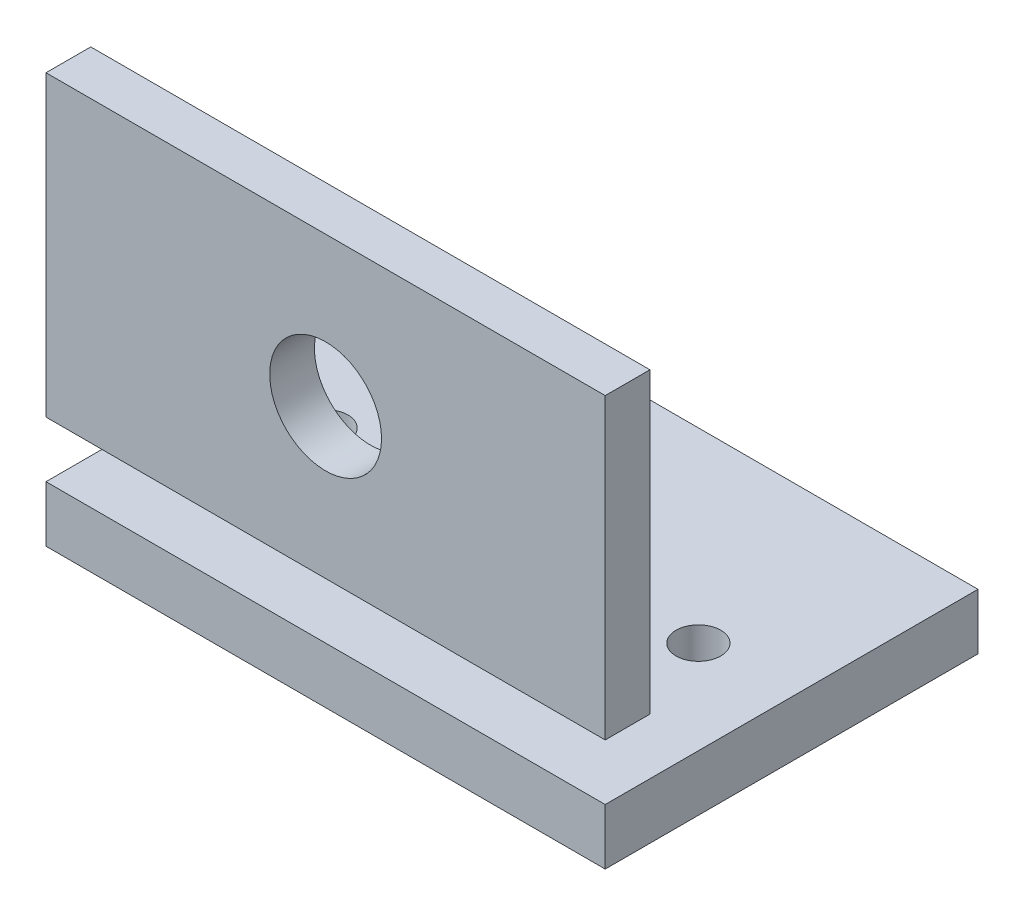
ISO-10303-21;
HEADER;
FILE_DESCRIPTION(('STEP AP214'),'2;1');
FILE_NAME('part.step','',(''),(''),'','','');
FILE_SCHEMA(('AUTOMOTIVE_DESIGN { 1 0 10303 214 1 1 1 1 }'));
ENDSEC;
DATA;
#1=APPLICATION_CONTEXT('core data for automotive mechanical design processes');
#2=APPLICATION_PROTOCOL_DEFINITION('international standard','automotive_design',2000,#1);
#3=PRODUCT_CONTEXT('',#1,'mechanical');
#4=PRODUCT('Part','Part','',(#3));
#5=PRODUCT_RELATED_PRODUCT_CATEGORY('part','',(#4));
#6=PRODUCT_DEFINITION_FORMATION('','',#4);
#7=PRODUCT_DEFINITION_CONTEXT('part definition',#1,'design');
#8=PRODUCT_DEFINITION('design','',#6,#7);
#9=PRODUCT_DEFINITION_SHAPE('','',#8);
#10=(LENGTH_UNIT() NAMED_UNIT(*) SI_UNIT(.MILLI.,.METRE.));
#11=(NAMED_UNIT(*) PLANE_ANGLE_UNIT() SI_UNIT($,.RADIAN.));
#12=(NAMED_UNIT(*) SI_UNIT($,.STERADIAN.) SOLID_ANGLE_UNIT());
#13=UNCERTAINTY_MEASURE_WITH_UNIT(LENGTH_MEASURE(1.E-05),#10,'distance_accuracy_value','');
#14=(GEOMETRIC_REPRESENTATION_CONTEXT(3) GLOBAL_UNCERTAINTY_ASSIGNED_CONTEXT((#13)) GLOBAL_UNIT_ASSIGNED_CONTEXT((#10,
#11,#12)) REPRESENTATION_CONTEXT('',''));
#15=CARTESIAN_POINT('',(0.,0.,0.));
#16=DIRECTION('',(0.,0.,1.));
#17=DIRECTION('',(1.,0.,0.));
#18=AXIS2_PLACEMENT_3D('',#15,#16,#17);
#19=CARTESIAN_POINT('',(0.,15.,-12.));
#20=DIRECTION('',(-1.,0.,0.));
#21=DIRECTION('',(0.,0.,1.));
#22=AXIS2_PLACEMENT_3D('',#19,#20,#21);
#23=PLANE('',#22);
#24=DIRECTION('',(0.,-1.,0.));
#25=VECTOR('',#24,1.);
#26=CARTESIAN_POINT('',(0.,15.,0.));
#27=LINE('',#26,#25);
#28=CARTESIAN_POINT('',(0.,95.,0.));
#29=VERTEX_POINT('',#28);
#30=CARTESIAN_POINT('',(0.,15.,0.));
#31=VERTEX_POINT('',#30);
#32=EDGE_CURVE('E118',#29,#31,#27,.T.);
#33=ORIENTED_EDGE('',*,*,#32,.F.);
#34=DIRECTION('',(0.,0.,1.));
#35=VECTOR('',#34,1.);
#36=CARTESIAN_POINT('',(0.,95.,-12.));
#37=LINE('',#36,#35);
#38=CARTESIAN_POINT('',(0.,95.,-12.));
#39=VERTEX_POINT('',#38);
#40=EDGE_CURVE('E12',#39,#29,#37,.T.);
#41=ORIENTED_EDGE('',*,*,#40,.F.);
#42=DIRECTION('',(0.,-1.,0.));
#43=VECTOR('',#42,1.);
#44=CARTESIAN_POINT('',(0.,15.,-12.));
#45=LINE('',#44,#43);
#46=CARTESIAN_POINT('',(0.,15.,-12.));
#47=VERTEX_POINT('',#46);
#48=EDGE_CURVE('E108',#39,#47,#45,.T.);
#49=ORIENTED_EDGE('',*,*,#48,.T.);
#50=DIRECTION('',(0.,0.,1.));
#51=VECTOR('',#50,1.);
#52=CARTESIAN_POINT('',(0.,15.,-12.));
#53=LINE('',#52,#51);
#54=EDGE_CURVE('E53',#47,#31,#53,.T.);
#55=ORIENTED_EDGE('',*,*,#54,.T.);
#56=EDGE_LOOP('',(#33,#41,#49,#55));
#57=FACE_BOUND('',#56,.T.);
#58=ADVANCED_FACE('F51',(#57),#23,.T.);
#59=CARTESIAN_POINT('',(0.,95.,-12.));
#60=DIRECTION('',(0.,1.,0.));
#61=DIRECTION('',(0.,0.,1.));
#62=AXIS2_PLACEMENT_3D('',#59,#60,#61);
#63=PLANE('',#62);
#64=DIRECTION('',(-1.,0.,0.));
#65=VECTOR('',#64,1.);
#66=CARTESIAN_POINT('',(0.,95.,0.));
#67=LINE('',#66,#65);
#68=CARTESIAN_POINT('',(150.,95.,0.));
#69=VERTEX_POINT('',#68);
#70=EDGE_CURVE('E112',#69,#29,#67,.T.);
#71=ORIENTED_EDGE('',*,*,#70,.F.);
#72=DIRECTION('',(0.,0.,1.));
#73=VECTOR('',#72,1.);
#74=CARTESIAN_POINT('',(150.,95.,-12.));
#75=LINE('',#74,#73);
#76=CARTESIAN_POINT('',(150.,95.,-12.));
#77=VERTEX_POINT('',#76);
#78=EDGE_CURVE('E58',#77,#69,#75,.T.);
#79=ORIENTED_EDGE('',*,*,#78,.F.);
#80=DIRECTION('',(-1.,0.,0.));
#81=VECTOR('',#80,1.);
#82=CARTESIAN_POINT('',(0.,95.,-12.));
#83=LINE('',#82,#81);
#84=EDGE_CURVE('E106',#77,#39,#83,.T.);
#85=ORIENTED_EDGE('',*,*,#84,.T.);
#86=ORIENTED_EDGE('',*,*,#40,.T.);
#87=EDGE_LOOP('',(#71,#79,#85,#86));
#88=FACE_BOUND('',#87,.T.);
#89=ADVANCED_FACE('F130',(#88),#63,.T.);
#90=CARTESIAN_POINT('',(150.,15.,-12.));
#91=DIRECTION('',(1.,0.,0.));
#92=DIRECTION('',(0.,0.,-1.));
#93=AXIS2_PLACEMENT_3D('',#90,#91,#92);
#94=PLANE('',#93);
#95=DIRECTION('',(0.,1.,0.));
#96=VECTOR('',#95,1.);
#97=CARTESIAN_POINT('',(150.,15.,0.));
#98=LINE('',#97,#96);
#99=CARTESIAN_POINT('',(150.,15.,0.));
#100=VERTEX_POINT('',#99);
#101=EDGE_CURVE('E101',#100,#69,#98,.T.);
#102=ORIENTED_EDGE('',*,*,#101,.F.);
#103=DIRECTION('',(0.,0.,1.));
#104=VECTOR('',#103,1.);
#105=CARTESIAN_POINT('',(150.,15.,-12.));
#106=LINE('',#105,#104);
#107=CARTESIAN_POINT('',(150.,15.,-12.));
#108=VERTEX_POINT('',#107);
#109=EDGE_CURVE('E96',#108,#100,#106,.T.);
#110=ORIENTED_EDGE('',*,*,#109,.F.);
#111=DIRECTION('',(0.,1.,0.));
#112=VECTOR('',#111,1.);
#113=CARTESIAN_POINT('',(150.,15.,-12.));
#114=LINE('',#113,#112);
#115=EDGE_CURVE('E97',#108,#77,#114,.T.);
#116=ORIENTED_EDGE('',*,*,#115,.T.);
#117=ORIENTED_EDGE('',*,*,#78,.T.);
#118=EDGE_LOOP('',(#102,#110,#116,#117));
#119=FACE_BOUND('',#118,.T.);
#120=ADVANCED_FACE('F98',(#119),#94,.T.);
#121=CARTESIAN_POINT('',(0.,15.,-12.));
#122=DIRECTION('',(0.,-1.,0.));
#123=DIRECTION('',(0.,0.,-1.));
#124=AXIS2_PLACEMENT_3D('',#121,#122,#123);
#125=PLANE('',#124);
#126=DIRECTION('',(1.,0.,0.));
#127=VECTOR('',#126,1.);
#128=CARTESIAN_POINT('',(0.,15.,0.));
#129=LINE('',#128,#127);
#130=EDGE_CURVE('E120',#31,#100,#129,.T.);
#131=ORIENTED_EDGE('',*,*,#130,.F.);
#132=ORIENTED_EDGE('',*,*,#54,.F.);
#133=DIRECTION('',(1.,0.,0.));
#134=VECTOR('',#133,1.);
#135=CARTESIAN_POINT('',(0.,15.,-12.));
#136=LINE('',#135,#134);
#137=EDGE_CURVE('E104',#47,#108,#136,.T.);
#138=ORIENTED_EDGE('',*,*,#137,.T.);
#139=ORIENTED_EDGE('',*,*,#109,.T.);
#140=EDGE_LOOP('',(#131,#132,#138,#139));
#141=FACE_BOUND('',#140,.T.);
#142=ADVANCED_FACE('F107',(#141),#125,.T.);
#143=CARTESIAN_POINT('',(0.,0.,-12.));
#144=DIRECTION('',(0.,0.,-1.));
#145=DIRECTION('',(-1.,0.,0.));
#146=AXIS2_PLACEMENT_3D('',#143,#144,#145);
#147=PLANE('',#146);
#148=CARTESIAN_POINT('',(75.,55.,-12.));
#149=DIRECTION('',(0.,0.,1.));
#150=DIRECTION('',(1.,0.,0.));
#151=AXIS2_PLACEMENT_3D('',#148,#149,#150);
#152=CIRCLE('',#151,15.);
#153=CARTESIAN_POINT('',(90.,55.,-12.));
#154=VERTEX_POINT('',#153);
#155=EDGE_CURVE('E116',#154,#154,#152,.T.);
#156=ORIENTED_EDGE('',*,*,#155,.T.);
#157=EDGE_LOOP('',(#156));
#158=FACE_BOUND('',#157,.T.);
#159=ORIENTED_EDGE('',*,*,#48,.F.);
#160=ORIENTED_EDGE('',*,*,#84,.F.);
#161=ORIENTED_EDGE('',*,*,#115,.F.);
#162=ORIENTED_EDGE('',*,*,#137,.F.);
#163=EDGE_LOOP('',(#159,#160,#161,#162));
#164=FACE_BOUND('',#163,.T.);
#165=ADVANCED_FACE('F102',(#158,#164),#147,.T.);
#166=CARTESIAN_POINT('',(0.,0.,0.));
#167=DIRECTION('',(0.,0.,-1.));
#168=DIRECTION('',(-1.,0.,0.));
#169=AXIS2_PLACEMENT_3D('',#166,#167,#168);
#170=PLANE('',#169);
#171=CARTESIAN_POINT('',(75.,55.,0.));
#172=DIRECTION('',(0.,0.,1.));
#173=DIRECTION('',(1.,0.,0.));
#174=AXIS2_PLACEMENT_3D('',#171,#172,#173);
#175=CIRCLE('',#174,15.);
#176=CARTESIAN_POINT('',(90.,55.,0.));
#177=VERTEX_POINT('',#176);
#178=EDGE_CURVE('E160',#177,#177,#175,.T.);
#179=ORIENTED_EDGE('',*,*,#178,.F.);
#180=EDGE_LOOP('',(#179));
#181=FACE_BOUND('',#180,.T.);
#182=ORIENTED_EDGE('',*,*,#32,.T.);
#183=ORIENTED_EDGE('',*,*,#130,.T.);
#184=ORIENTED_EDGE('',*,*,#101,.T.);
#185=ORIENTED_EDGE('',*,*,#70,.T.);
#186=EDGE_LOOP('',(#182,#183,#184,#185));
#187=FACE_BOUND('',#186,.T.);
#188=ADVANCED_FACE('F127',(#181,#187),#170,.F.);
#189=CARTESIAN_POINT('',(75.,55.,-12.));
#190=DIRECTION('',(0.,0.,1.));
#191=DIRECTION('',(1.,0.,0.));
#192=AXIS2_PLACEMENT_3D('',#189,#190,#191);
#193=CYLINDRICAL_SURFACE('',#192,15.);
#194=ORIENTED_EDGE('',*,*,#155,.F.);
#195=EDGE_LOOP('',(#194));
#196=FACE_BOUND('',#195,.T.);
#197=ORIENTED_EDGE('',*,*,#178,.T.);
#198=EDGE_LOOP('',(#197));
#199=FACE_BOUND('',#198,.T.);
#200=ADVANCED_FACE('F144',(#196,#199),#193,.F.);
#201=CLOSED_SHELL('',(#58,#89,#120,#142,#165,#188,#200));
#202=MANIFOLD_SOLID_BREP('B2',#201);
#203=CARTESIAN_POINT('',(0.,-15.,0.));
#204=DIRECTION('',(-1.,0.,0.));
#205=DIRECTION('',(0.,0.,1.));
#206=AXIS2_PLACEMENT_3D('',#203,#204,#205);
#207=PLANE('',#206);
#208=DIRECTION('',(0.,0.,1.));
#209=VECTOR('',#208,1.);
#210=CARTESIAN_POINT('',(0.,0.,0.));
#211=LINE('',#210,#209);
#212=CARTESIAN_POINT('',(0.,0.,-100.));
#213=VERTEX_POINT('',#212);
#214=CARTESIAN_POINT('',(0.,0.,0.));
#215=VERTEX_POINT('',#214);
#216=EDGE_CURVE('E261',#213,#215,#211,.T.);
#217=ORIENTED_EDGE('',*,*,#216,.F.);
#218=DIRECTION('',(0.,1.,0.));
#219=VECTOR('',#218,1.);
#220=CARTESIAN_POINT('',(0.,-15.,-100.));
#221=LINE('',#220,#219);
#222=CARTESIAN_POINT('',(0.,-15.,-100.));
#223=VERTEX_POINT('',#222);
#224=EDGE_CURVE('E47',#223,#213,#221,.T.);
#225=ORIENTED_EDGE('',*,*,#224,.F.);
#226=DIRECTION('',(0.,0.,1.));
#227=VECTOR('',#226,1.);
#228=CARTESIAN_POINT('',(0.,-15.,0.));
#229=LINE('',#228,#227);
#230=CARTESIAN_POINT('',(0.,-15.,0.));
#231=VERTEX_POINT('',#230);
#232=EDGE_CURVE('E255',#223,#231,#229,.T.);
#233=ORIENTED_EDGE('',*,*,#232,.T.);
#234=DIRECTION('',(0.,1.,0.));
#235=VECTOR('',#234,1.);
#236=CARTESIAN_POINT('',(0.,-15.,0.));
#237=LINE('',#236,#235);
#238=EDGE_CURVE('E200',#231,#215,#237,.T.);
#239=ORIENTED_EDGE('',*,*,#238,.T.);
#240=EDGE_LOOP('',(#217,#225,#233,#239));
#241=FACE_BOUND('',#240,.T.);
#242=ADVANCED_FACE('F198',(#241),#207,.T.);
#243=CARTESIAN_POINT('',(0.,-15.,-100.));
#244=DIRECTION('',(0.,0.,-1.));
#245=DIRECTION('',(-1.,0.,0.));
#246=AXIS2_PLACEMENT_3D('',#243,#244,#245);
#247=PLANE('',#246);
#248=DIRECTION('',(-1.,0.,0.));
#249=VECTOR('',#248,1.);
#250=CARTESIAN_POINT('',(0.,0.,-100.));
#251=LINE('',#250,#249);
#252=CARTESIAN_POINT('',(150.,0.,-100.));
#253=VERTEX_POINT('',#252);
#254=EDGE_CURVE('E258',#253,#213,#251,.T.);
#255=ORIENTED_EDGE('',*,*,#254,.F.);
#256=DIRECTION('',(0.,1.,0.));
#257=VECTOR('',#256,1.);
#258=CARTESIAN_POINT('',(150.,-15.,-100.));
#259=LINE('',#258,#257);
#260=CARTESIAN_POINT('',(150.,-15.,-100.));
#261=VERTEX_POINT('',#260);
#262=EDGE_CURVE('E202',#261,#253,#259,.T.);
#263=ORIENTED_EDGE('',*,*,#262,.F.);
#264=DIRECTION('',(-1.,0.,0.));
#265=VECTOR('',#264,1.);
#266=CARTESIAN_POINT('',(0.,-15.,-100.));
#267=LINE('',#266,#265);
#268=EDGE_CURVE('E253',#261,#223,#267,.T.);
#269=ORIENTED_EDGE('',*,*,#268,.T.);
#270=ORIENTED_EDGE('',*,*,#224,.T.);
#271=EDGE_LOOP('',(#255,#263,#269,#270));
#272=FACE_BOUND('',#271,.T.);
#273=ADVANCED_FACE('F275',(#272),#247,.T.);
#274=CARTESIAN_POINT('',(150.,-15.,0.));
#275=DIRECTION('',(1.,0.,0.));
#276=DIRECTION('',(0.,0.,-1.));
#277=AXIS2_PLACEMENT_3D('',#274,#275,#276);
#278=PLANE('',#277);
#279=DIRECTION('',(0.,0.,-1.));
#280=VECTOR('',#279,1.);
#281=CARTESIAN_POINT('',(150.,0.,0.));
#282=LINE('',#281,#280);
#283=CARTESIAN_POINT('',(150.,0.,0.));
#284=VERTEX_POINT('',#283);
#285=EDGE_CURVE('E247',#284,#253,#282,.T.);
#286=ORIENTED_EDGE('',*,*,#285,.F.);
#287=DIRECTION('',(0.,1.,0.));
#288=VECTOR('',#287,1.);
#289=CARTESIAN_POINT('',(150.,-15.,0.));
#290=LINE('',#289,#288);
#291=CARTESIAN_POINT('',(150.,-15.,0.));
#292=VERTEX_POINT('',#291);
#293=EDGE_CURVE('E243',#292,#284,#290,.T.);
#294=ORIENTED_EDGE('',*,*,#293,.F.);
#295=DIRECTION('',(0.,0.,-1.));
#296=VECTOR('',#295,1.);
#297=CARTESIAN_POINT('',(150.,-15.,0.));
#298=LINE('',#297,#296);
#299=EDGE_CURVE('E245',#292,#261,#298,.T.);
#300=ORIENTED_EDGE('',*,*,#299,.T.);
#301=ORIENTED_EDGE('',*,*,#262,.T.);
#302=EDGE_LOOP('',(#286,#294,#300,#301));
#303=FACE_BOUND('',#302,.T.);
#304=ADVANCED_FACE('F242',(#303),#278,.T.);
#305=CARTESIAN_POINT('',(0.,-15.,0.));
#306=DIRECTION('',(0.,0.,1.));
#307=DIRECTION('',(1.,0.,0.));
#308=AXIS2_PLACEMENT_3D('',#305,#306,#307);
#309=PLANE('',#308);
#310=DIRECTION('',(1.,0.,0.));
#311=VECTOR('',#310,1.);
#312=CARTESIAN_POINT('',(0.,0.,0.));
#313=LINE('',#312,#311);
#314=EDGE_CURVE('E262',#215,#284,#313,.T.);
#315=ORIENTED_EDGE('',*,*,#314,.F.);
#316=ORIENTED_EDGE('',*,*,#238,.F.);
#317=DIRECTION('',(1.,0.,0.));
#318=VECTOR('',#317,1.);
#319=CARTESIAN_POINT('',(0.,-15.,0.));
#320=LINE('',#319,#318);
#321=EDGE_CURVE('E248',#231,#292,#320,.T.);
#322=ORIENTED_EDGE('',*,*,#321,.T.);
#323=ORIENTED_EDGE('',*,*,#293,.T.);
#324=EDGE_LOOP('',(#315,#316,#322,#323));
#325=FACE_BOUND('',#324,.T.);
#326=ADVANCED_FACE('F251',(#325),#309,.T.);
#327=CARTESIAN_POINT('',(0.,-15.,0.));
#328=DIRECTION('',(0.,-1.,0.));
#329=DIRECTION('',(0.,0.,-1.));
#330=AXIS2_PLACEMENT_3D('',#327,#328,#329);
#331=PLANE('',#330);
#332=CARTESIAN_POINT('',(125.,-15.,-50.));
#333=DIRECTION('',(0.,1.,0.));
#334=DIRECTION('',(0.,0.,1.));
#335=AXIS2_PLACEMENT_3D('',#332,#333,#334);
#336=CIRCLE('',#335,6.00000000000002);
#337=CARTESIAN_POINT('',(125.,-15.,-44.));
#338=VERTEX_POINT('',#337);
#339=EDGE_CURVE('E264',#338,#338,#336,.T.);
#340=ORIENTED_EDGE('',*,*,#339,.T.);
#341=EDGE_LOOP('',(#340));
#342=FACE_BOUND('',#341,.T.);
#343=CARTESIAN_POINT('',(25.,-15.,-50.));
#344=DIRECTION('',(0.,1.,0.));
#345=DIRECTION('',(0.,0.,1.));
#346=AXIS2_PLACEMENT_3D('',#343,#344,#345);
#347=CIRCLE('',#346,6.);
#348=CARTESIAN_POINT('',(25.,-15.,-44.));
#349=VERTEX_POINT('',#348);
#350=EDGE_CURVE('E315',#349,#349,#347,.T.);
#351=ORIENTED_EDGE('',*,*,#350,.T.);
#352=EDGE_LOOP('',(#351));
#353=FACE_BOUND('',#352,.T.);
#354=ORIENTED_EDGE('',*,*,#232,.F.);
#355=ORIENTED_EDGE('',*,*,#268,.F.);
#356=ORIENTED_EDGE('',*,*,#299,.F.);
#357=ORIENTED_EDGE('',*,*,#321,.F.);
#358=EDGE_LOOP('',(#354,#355,#356,#357));
#359=FACE_BOUND('',#358,.T.);
#360=ADVANCED_FACE('F246',(#342,#353,#359),#331,.T.);
#361=CARTESIAN_POINT('',(0.,0.,0.));
#362=DIRECTION('',(0.,-1.,0.));
#363=DIRECTION('',(0.,0.,-1.));
#364=AXIS2_PLACEMENT_3D('',#361,#362,#363);
#365=PLANE('',#364);
#366=CARTESIAN_POINT('',(125.,0.,-50.));
#367=DIRECTION('',(0.,1.,0.));
#368=DIRECTION('',(0.,0.,1.));
#369=AXIS2_PLACEMENT_3D('',#366,#367,#368);
#370=CIRCLE('',#369,6.00000000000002);
#371=CARTESIAN_POINT('',(125.,0.,-44.));
#372=VERTEX_POINT('',#371);
#373=EDGE_CURVE('E307',#372,#372,#370,.T.);
#374=ORIENTED_EDGE('',*,*,#373,.F.);
#375=EDGE_LOOP('',(#374));
#376=FACE_BOUND('',#375,.T.);
#377=CARTESIAN_POINT('',(25.,0.,-50.));
#378=DIRECTION('',(0.,1.,0.));
#379=DIRECTION('',(0.,0.,1.));
#380=AXIS2_PLACEMENT_3D('',#377,#378,#379);
#381=CIRCLE('',#380,6.);
#382=CARTESIAN_POINT('',(25.,0.,-44.));
#383=VERTEX_POINT('',#382);
#384=EDGE_CURVE('E306',#383,#383,#381,.T.);
#385=ORIENTED_EDGE('',*,*,#384,.F.);
#386=EDGE_LOOP('',(#385));
#387=FACE_BOUND('',#386,.T.);
#388=ORIENTED_EDGE('',*,*,#216,.T.);
#389=ORIENTED_EDGE('',*,*,#314,.T.);
#390=ORIENTED_EDGE('',*,*,#285,.T.);
#391=ORIENTED_EDGE('',*,*,#254,.T.);
#392=EDGE_LOOP('',(#388,#389,#390,#391));
#393=FACE_BOUND('',#392,.T.);
#394=ADVANCED_FACE('F271',(#376,#387,#393),#365,.F.);
#395=CARTESIAN_POINT('',(25.,-15.,-50.));
#396=DIRECTION('',(0.,1.,0.));
#397=DIRECTION('',(0.,0.,1.));
#398=AXIS2_PLACEMENT_3D('',#395,#396,#397);
#399=CYLINDRICAL_SURFACE('',#398,6.);
#400=ORIENTED_EDGE('',*,*,#350,.F.);
#401=EDGE_LOOP('',(#400));
#402=FACE_BOUND('',#401,.T.);
#403=ORIENTED_EDGE('',*,*,#384,.T.);
#404=EDGE_LOOP('',(#403));
#405=FACE_BOUND('',#404,.T.);
#406=ADVANCED_FACE('F288',(#402,#405),#399,.F.);
#407=CARTESIAN_POINT('',(125.,-15.,-50.));
#408=DIRECTION('',(0.,1.,0.));
#409=DIRECTION('',(0.,0.,1.));
#410=AXIS2_PLACEMENT_3D('',#407,#408,#409);
#411=CYLINDRICAL_SURFACE('',#410,6.00000000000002);
#412=ORIENTED_EDGE('',*,*,#339,.F.);
#413=EDGE_LOOP('',(#412));
#414=FACE_BOUND('',#413,.T.);
#415=ORIENTED_EDGE('',*,*,#373,.T.);
#416=EDGE_LOOP('',(#415));
#417=FACE_BOUND('',#416,.T.);
#418=ADVANCED_FACE('F299',(#414,#417),#411,.F.);
#419=CLOSED_SHELL('',(#242,#273,#304,#326,#360,#394,#406,#418));
#420=MANIFOLD_SOLID_BREP('B6',#419);
#421=ADVANCED_BREP_SHAPE_REPRESENTATION('',(#18,#202,#420),#14);
#422=SHAPE_DEFINITION_REPRESENTATION(#9,#421);
ENDSEC;
END-ISO-10303-21;
